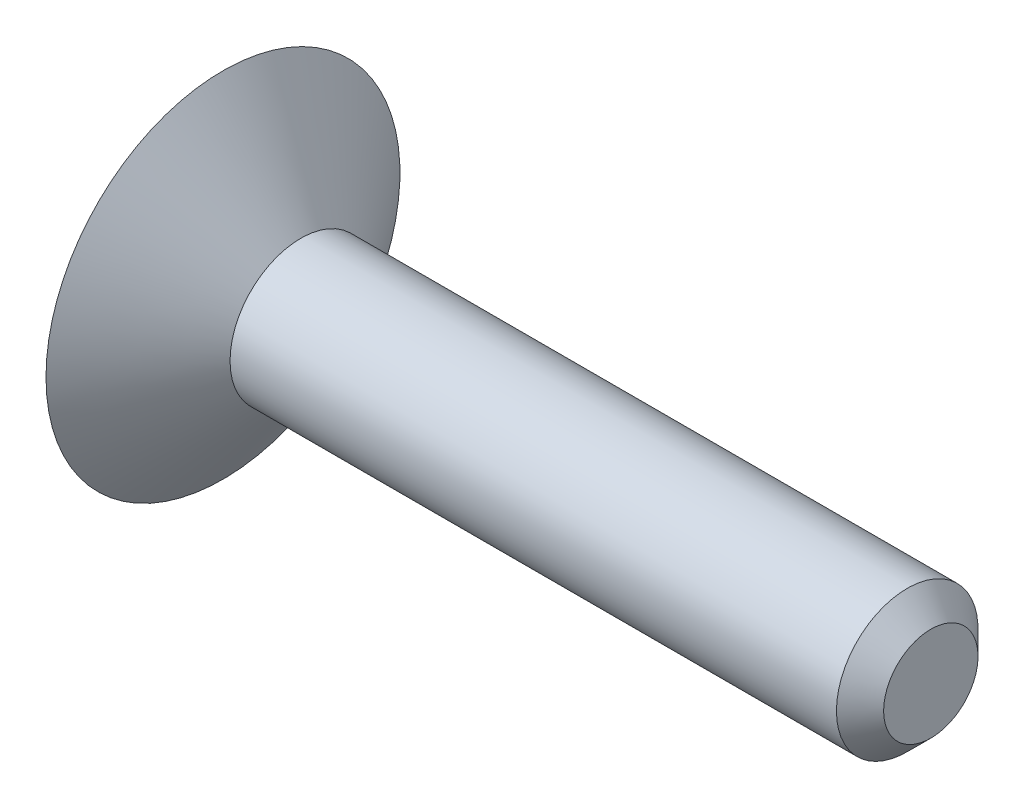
from build123d import *

# Parameters (mm, degrees)
ENL_V_MAT_EXTRU_1_DEPTH = 3


with BuildPart() as part:
    # Esquisse1 → Base-R_volution (revolve)
    with BuildSketch(Plane.XY, mode=Mode.PRIVATE) as base_r_volution_sk:
        Polygon((0, 0), (0, 7.5), (3.3, 3), (29, 3), (30, 2), (30, 0), align=None)
    revolve(base_r_volution_sk.sketch.rotate(Axis((-28.576196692, 0, 0), (1, 0, 0)), 90), axis=Axis((-28.576196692, 0, 0), (1, 0, 0)))

    # Esquisse2 → Enl_v. mat.-Extru.1 (cut)
    with BuildSketch(Plane(origin=(0, 5.465458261, -1.391437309), x_dir=(0, 0, 1), z_dir=(-1, 0, 0))):
        Polygon((-0.504565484, -7.659075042), (-1.508007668, -5.465458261), (-0.020287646, -2.932907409), (3.287440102, -3.271841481), (4.290882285, -5.465458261), (2.803162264, -7.998009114), align=None)
    extrude(amount=-ENL_V_MAT_EXTRU_1_DEPTH, mode=Mode.SUBTRACT)


solid = part.part
